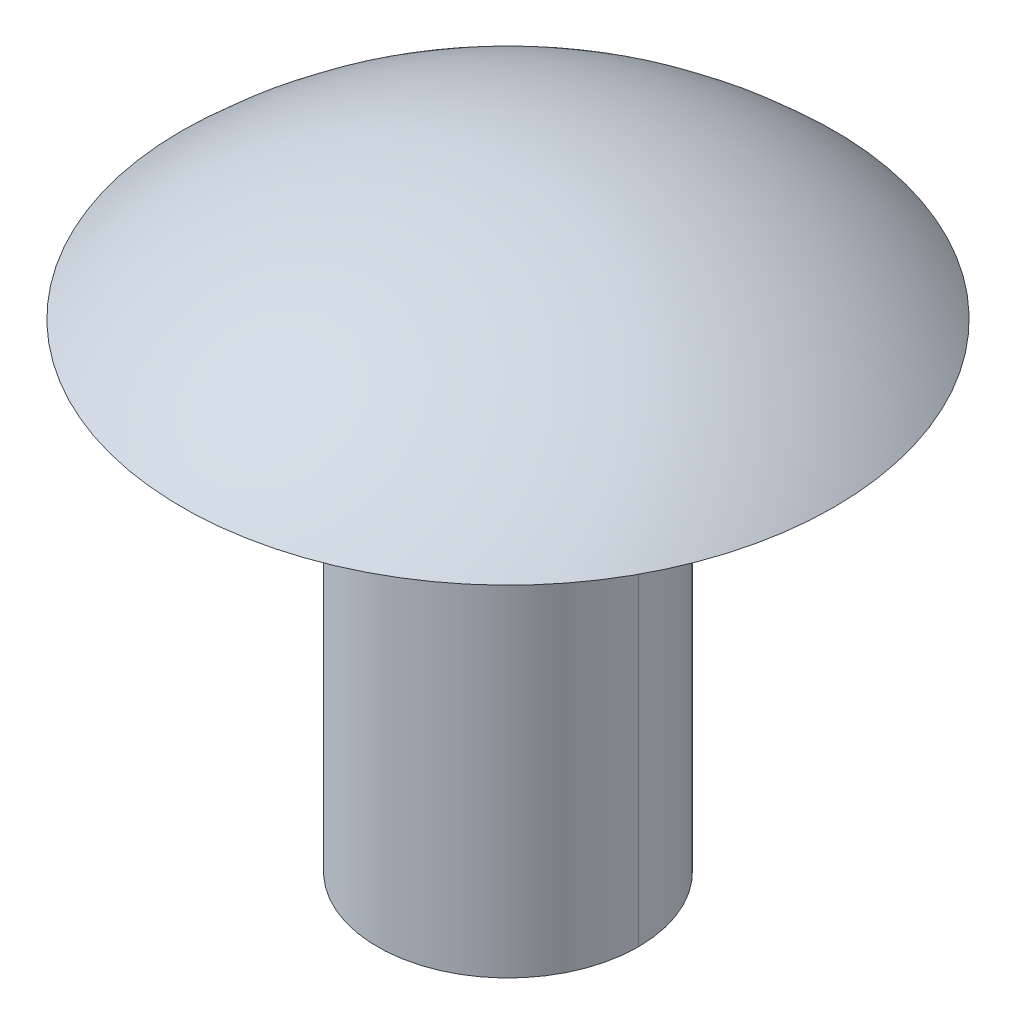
from build123d import *

# Parameters (mm, degrees)
SKETCH1_R           = 4.7625
BOSS_EXTRUDE1_DEPTH = 17.4625


with BuildPart() as part:
    # Sketch1 → Boss-Extrude1 (new body)
    with BuildSketch(Plane(origin=(0, 0, 0), x_dir=(1, 0, 0), z_dir=(0, 1, 0))):
        with Locations(Location((0, 0, 0), (0, 0, 270))):
            Circle(SKETCH1_R)
    extrude(amount=-BOSS_EXTRUDE1_DEPTH)

    # Sketch3 → Revolve1 (revolve)
    with BuildSketch(Plane.XY):
        with BuildLine():
            Line((0, 4.7498), (0, 0))
            Line((0, 0), (11.8999, 0))
            ThreePointArc((11.8999, 0), (6.406407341, 3.5184843), (0, 4.7498))
        make_face()
    revolve(axis=Axis((0, 4.7498, 0), (0, -1, 0)))


solid = part.part
